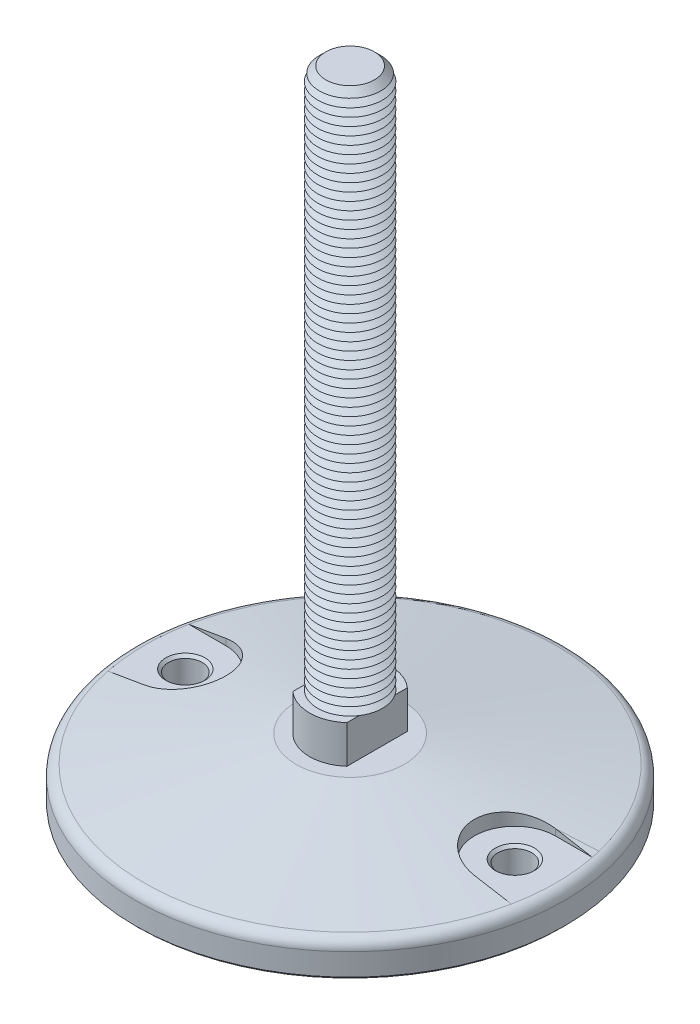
from build123d import *

# Parameters (mm, degrees)
FILLET1_R                = 4
SKETCH3_R                = 15
BOSS_EXTRUDE1_DEPTH      = 14
CUT_EXTRUDE1_START       = -14
CUT_EXTRUDE1_DEPTH       = 14
SKETCH5_R                = 12
BOSS_EXTRUDE2_DEPTH      = 200
CHAMFER1_SIZE            = 3
LPATTERN1_COUNT          = 66
LPATTERN1_PITCH          = 3
CUT_EXTRUDE4_DEPTH       = 9.91
SKETCH10_R               = 6.25
CUT_EXTRUDE5_DEPTH       = 13.09
CHAMFER2_SIZE            = 1
CHAMFER2_OF_MIRROR1_SIZE = 1
CHAMFER3_SIZE            = 1


with BuildPart() as part:
    # Sketch2 → Revolve1 (revolve)
    with BuildSketch(Plane(origin=(0, 0, 0), x_dir=(0, 0, -1), z_dir=(1, 0, 0)), mode=Mode.PRIVATE) as revolve1_sk:
        Polygon((0, 0), (-20, 0), (-79.5, -10.491455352), (-79.5, -23), (0, -23), align=None)
    revolve(revolve1_sk.sketch.rotate(Axis((0, 61.338865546, 0), (0, -1, 0)), 180), axis=Axis((0, 61.338865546, 0), (0, -1, 0)))

    # Fillet1
    fillet1_edges = [part.edges().sort_by_distance(p)[0] for p in [
        (0, -10.491455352, 79.5),
    ]]
    fillet(fillet1_edges, radius=FILLET1_R)

    # Sketch3 → Boss-Extrude1 (add)
    with BuildSketch(Plane(origin=(0, 0, 0), x_dir=(1, 0, 0), z_dir=(0, 1, 0))):
        with Locations(Location((0, 0, 0), (0, 0, 270))):
            Circle(SKETCH3_R)
    extrude(amount=BOSS_EXTRUDE1_DEPTH)

    # Sketch4 → Cut-Extrude1 (cut)
    with BuildSketch(Plane(origin=(0, 14, 0), x_dir=(1, 0, 0), z_dir=(0, 1, 0)).offset(CUT_EXTRUDE1_START)):
        with BuildLine():
            Line((-10, 11.180339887), (-10, -11.180339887))
            ThreePointArc((-10, -11.180339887), (-15, 0), (-10, 11.180339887))
        make_face()
        with BuildLine():
            Line((10, -11.180339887), (10, 11.180339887))
            ThreePointArc((10, 11.180339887), (15, 0), (10, -11.180339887))
        make_face()
    extrude(amount=CUT_EXTRUDE1_DEPTH, mode=Mode.SUBTRACT)

    # Sketch5 → Boss-Extrude2 (add)
    with BuildSketch(Plane(origin=(0, 14, 0), x_dir=(1, 0, 0), z_dir=(0, 1, 0))):
        with Locations(Location((0, 0, 0), (0, 0, 33.557309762))):
            Circle(SKETCH5_R)
    extrude(amount=BOSS_EXTRUDE2_DEPTH)

    # Chamfer1
    chamfer1_edges = [part.edges().sort_by_distance(p)[0] for p in [
        (-10, 214, 6.633249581),
    ]]
    chamfer(chamfer1_edges, length=CHAMFER1_SIZE)

    # Sketch6 → Cut-Revolve1 (revolve, cut)
    with BuildSketch(Plane(origin=(0, 0, 0), x_dir=(0, 0, -1), z_dir=(1, 0, 0))):
        Polygon((-12, 14), (-9.401923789, 15.5), (-12, 17), align=None)
    cut_revolve1 = revolve(axis=Axis((0, 61.338865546, 0), (0, -1, 0)), mode=Mode.SUBTRACT)

    # LPattern1: Cut-Revolve1 ×66
    with Locations(*[(0, i * LPATTERN1_PITCH, 0) for i in range(1, LPATTERN1_COUNT)]):
        add(cut_revolve1, mode=Mode.SUBTRACT)

    # Sketch8 → Cut-Extrude4 (cut)
    with BuildSketch(Plane(origin=(0, 0, 0), x_dir=(1, 0, 0), z_dir=(0, 1, 0))):
        with BuildLine():
            Line((-61, 15), (-74.703520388, 15))
            ThreePointArc((-74.703520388, 15), (-76.194592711, 0), (-74.703520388, -15))
            Line((-74.703520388, -15), (-61, -15))
            ThreePointArc((-61, -15), (-46, 0), (-61, 15))
        make_face()
    cut_extrude4 = extrude(amount=-CUT_EXTRUDE4_DEPTH, mode=Mode.SUBTRACT)

    # Sketch10 → Cut-Extrude5 (cut)
    with BuildSketch(Plane(origin=(0, -9.91, 0), x_dir=(1, 0, 0), z_dir=(0, 1, 0))):
        with Locations(Location((-61, 0, 0), (0, 0, 270))):
            Circle(SKETCH10_R)
    cut_extrude5 = extrude(amount=-CUT_EXTRUDE5_DEPTH, mode=Mode.SUBTRACT)

    # Chamfer2
    chamfer2_edges = [part.edges().sort_by_distance(p)[0] for p in [
        (-61, -9.91, -6.25),
        (-61, -23, -6.25),
    ]]
    chamfer(chamfer2_edges, length=CHAMFER2_SIZE)

    # Mirror1: Cut-Extrude4, Cut-Extrude5 across plane
    add(cut_extrude4.mirror(Plane(origin=(0, 0, 0), x_dir=(0, 0, 1), z_dir=(1, 0, 0))), mode=Mode.SUBTRACT)
    add(cut_extrude5.mirror(Plane(origin=(0, 0, 0), x_dir=(0, 0, 1), z_dir=(1, 0, 0))), mode=Mode.SUBTRACT)

    # Chamfer2 of Mirror1
    chamfer2_of_mirror1_edges = [part.edges().sort_by_distance(p)[0] for p in [
        (61, -9.91, -6.25),
        (61, -23, -6.25),
    ]]
    chamfer(chamfer2_of_mirror1_edges, length=CHAMFER2_OF_MIRROR1_SIZE)

    # Chamfer3
    chamfer3_edges = [part.edges().sort_by_distance(p)[0] for p in [
        (0, -23, 79.5),
    ]]
    chamfer(chamfer3_edges, length=CHAMFER3_SIZE)


solid = part.part
